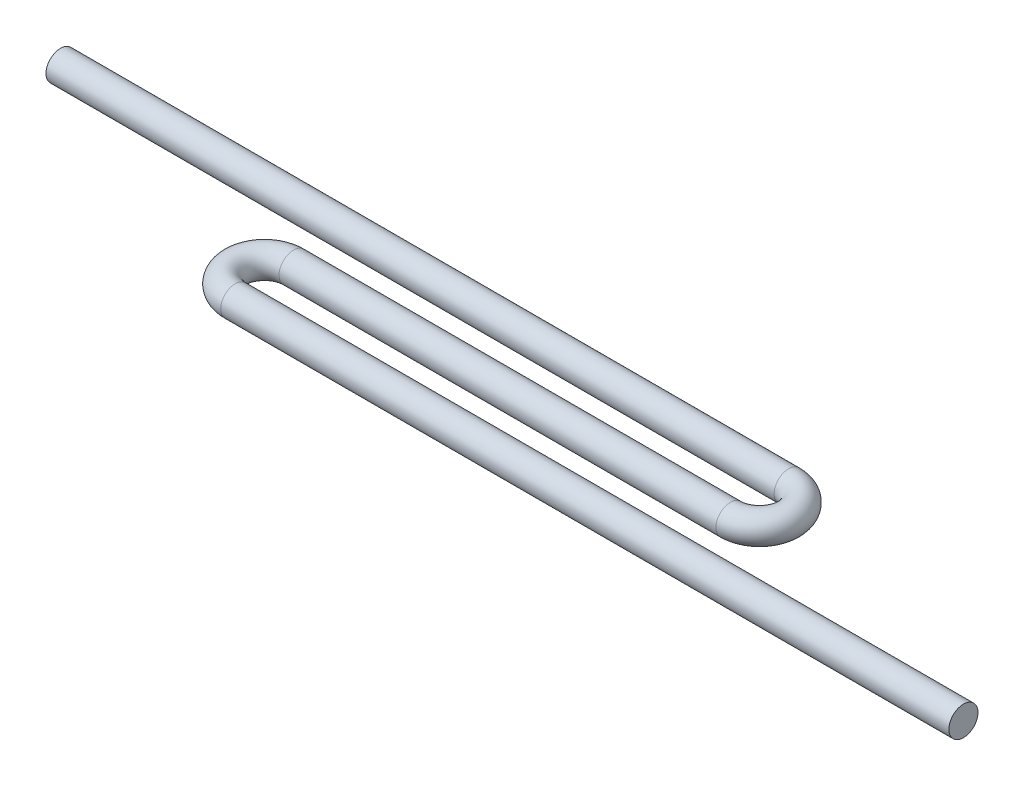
ISO-10303-21;
HEADER;
FILE_DESCRIPTION(('STEP AP214'),'2;1');
FILE_NAME('part.step','',(''),(''),'','','');
FILE_SCHEMA(('AUTOMOTIVE_DESIGN { 1 0 10303 214 1 1 1 1 }'));
ENDSEC;
DATA;
#1=APPLICATION_CONTEXT('core data for automotive mechanical design processes');
#2=APPLICATION_PROTOCOL_DEFINITION('international standard','automotive_design',2000,#1);
#3=PRODUCT_CONTEXT('',#1,'mechanical');
#4=PRODUCT('Part','Part','',(#3));
#5=PRODUCT_RELATED_PRODUCT_CATEGORY('part','',(#4));
#6=PRODUCT_DEFINITION_FORMATION('','',#4);
#7=PRODUCT_DEFINITION_CONTEXT('part definition',#1,'design');
#8=PRODUCT_DEFINITION('design','',#6,#7);
#9=PRODUCT_DEFINITION_SHAPE('','',#8);
#10=(LENGTH_UNIT() NAMED_UNIT(*) SI_UNIT(.MILLI.,.METRE.));
#11=(NAMED_UNIT(*) PLANE_ANGLE_UNIT() SI_UNIT($,.RADIAN.));
#12=(NAMED_UNIT(*) SI_UNIT($,.STERADIAN.) SOLID_ANGLE_UNIT());
#13=UNCERTAINTY_MEASURE_WITH_UNIT(LENGTH_MEASURE(1.E-05),#10,'distance_accuracy_value','');
#14=(GEOMETRIC_REPRESENTATION_CONTEXT(3) GLOBAL_UNCERTAINTY_ASSIGNED_CONTEXT((#13)) GLOBAL_UNIT_ASSIGNED_CONTEXT((#10,
#11,#12)) REPRESENTATION_CONTEXT('',''));
#15=CARTESIAN_POINT('',(0.,0.,0.));
#16=DIRECTION('',(0.,0.,1.));
#17=DIRECTION('',(1.,0.,0.));
#18=AXIS2_PLACEMENT_3D('',#15,#16,#17);
#19=CARTESIAN_POINT('',(100.,0.,40.));
#20=DIRECTION('',(1.,0.,0.));
#21=DIRECTION('',(0.,0.,-1.));
#22=AXIS2_PLACEMENT_3D('',#19,#20,#21);
#23=CYLINDRICAL_SURFACE('',#22,5.);
#24=CARTESIAN_POINT('',(100.,0.,40.));
#25=DIRECTION('',(1.,0.,0.));
#26=DIRECTION('',(0.,0.,-1.));
#27=AXIS2_PLACEMENT_3D('',#24,#25,#26);
#28=CIRCLE('',#27,5.);
#29=CARTESIAN_POINT('',(100.,0.,45.));
#30=VERTEX_POINT('',#29);
#31=EDGE_CURVE('E62',#30,#30,#28,.T.);
#32=ORIENTED_EDGE('',*,*,#31,.T.);
#33=EDGE_LOOP('',(#32));
#34=FACE_BOUND('',#33,.T.);
#35=CARTESIAN_POINT('',(350.,0.,40.));
#36=DIRECTION('',(1.,0.,0.));
#37=DIRECTION('',(0.,0.,-1.));
#38=AXIS2_PLACEMENT_3D('',#35,#36,#37);
#39=CIRCLE('',#38,5.);
#40=CARTESIAN_POINT('',(350.,0.,35.));
#41=VERTEX_POINT('',#40);
#42=EDGE_CURVE('E47',#41,#41,#39,.T.);
#43=ORIENTED_EDGE('',*,*,#42,.F.);
#44=EDGE_LOOP('',(#43));
#45=FACE_BOUND('',#44,.T.);
#46=ADVANCED_FACE('F30',(#34,#45),#23,.T.);
#47=CARTESIAN_POINT('',(100.,0.,30.));
#48=DIRECTION('',(0.,1.,0.));
#49=DIRECTION('',(0.,0.,1.));
#50=AXIS2_PLACEMENT_3D('',#47,#48,#49);
#51=TOROIDAL_SURFACE('',#50,10.,5.);
#52=CARTESIAN_POINT('',(100.,0.,20.));
#53=DIRECTION('',(-1.,0.,0.));
#54=DIRECTION('',(0.,0.,1.));
#55=AXIS2_PLACEMENT_3D('',#52,#53,#54);
#56=CIRCLE('',#55,5.);
#57=CARTESIAN_POINT('',(100.,0.,15.));
#58=VERTEX_POINT('',#57);
#59=EDGE_CURVE('E66',#58,#58,#56,.T.);
#60=CARTESIAN_POINT('',(100.,0.,30.));
#61=DIRECTION('',(0.,1.,0.));
#62=DIRECTION('',(0.,0.,1.));
#63=AXIS2_PLACEMENT_3D('',#60,#61,#62);
#64=CIRCLE('',#63,15.);
#65=EDGE_CURVE('',#58,#30,#64,.T.);
#66=ORIENTED_EDGE('',*,*,#59,.T.);
#67=ORIENTED_EDGE('',*,*,#31,.F.);
#68=ORIENTED_EDGE('',*,*,#65,.T.);
#69=ORIENTED_EDGE('',*,*,#65,.F.);
#70=EDGE_LOOP('',(#66,#68,#67,#69));
#71=FACE_BOUND('',#70,.T.);
#72=ADVANCED_FACE('F101',(#71),#51,.T.);
#73=CARTESIAN_POINT('',(250.,0.,20.));
#74=DIRECTION('',(-1.,0.,0.));
#75=DIRECTION('',(0.,0.,1.));
#76=AXIS2_PLACEMENT_3D('',#73,#74,#75);
#77=CYLINDRICAL_SURFACE('',#76,5.);
#78=CARTESIAN_POINT('',(250.,0.,20.));
#79=DIRECTION('',(-1.,0.,0.));
#80=DIRECTION('',(0.,0.,1.));
#81=AXIS2_PLACEMENT_3D('',#78,#79,#80);
#82=CIRCLE('',#81,5.);
#83=CARTESIAN_POINT('',(250.,0.,25.));
#84=VERTEX_POINT('',#83);
#85=EDGE_CURVE('E70',#84,#84,#82,.T.);
#86=ORIENTED_EDGE('',*,*,#85,.T.);
#87=EDGE_LOOP('',(#86));
#88=FACE_BOUND('',#87,.T.);
#89=ORIENTED_EDGE('',*,*,#59,.F.);
#90=EDGE_LOOP('',(#89));
#91=FACE_BOUND('',#90,.T.);
#92=ADVANCED_FACE('F106',(#88,#91),#77,.T.);
#93=CARTESIAN_POINT('',(250.,0.,10.));
#94=DIRECTION('',(0.,-1.,0.));
#95=DIRECTION('',(0.,0.,-1.));
#96=AXIS2_PLACEMENT_3D('',#93,#94,#95);
#97=TOROIDAL_SURFACE('',#96,10.,5.);
#98=CARTESIAN_POINT('',(250.,0.,0.));
#99=DIRECTION('',(1.,0.,0.));
#100=DIRECTION('',(0.,0.,-1.));
#101=AXIS2_PLACEMENT_3D('',#98,#99,#100);
#102=CIRCLE('',#101,5.);
#103=CARTESIAN_POINT('',(250.,0.,-5.));
#104=VERTEX_POINT('',#103);
#105=EDGE_CURVE('E75',#104,#104,#102,.T.);
#106=CARTESIAN_POINT('',(250.,0.,10.));
#107=DIRECTION('',(0.,-1.,0.));
#108=DIRECTION('',(0.,0.,-1.));
#109=AXIS2_PLACEMENT_3D('',#106,#107,#108);
#110=CIRCLE('',#109,15.);
#111=EDGE_CURVE('',#104,#84,#110,.T.);
#112=ORIENTED_EDGE('',*,*,#105,.T.);
#113=ORIENTED_EDGE('',*,*,#85,.F.);
#114=ORIENTED_EDGE('',*,*,#111,.T.);
#115=ORIENTED_EDGE('',*,*,#111,.F.);
#116=EDGE_LOOP('',(#112,#114,#113,#115));
#117=FACE_BOUND('',#116,.T.);
#118=ADVANCED_FACE('F82',(#117),#97,.T.);
#119=CARTESIAN_POINT('',(250.,0.,0.));
#120=DIRECTION('',(-1.,0.,0.));
#121=DIRECTION('',(0.,0.,1.));
#122=AXIS2_PLACEMENT_3D('',#119,#120,#121);
#123=CYLINDRICAL_SURFACE('',#122,5.);
#124=ORIENTED_EDGE('',*,*,#105,.F.);
#125=EDGE_LOOP('',(#124));
#126=FACE_BOUND('',#125,.T.);
#127=CARTESIAN_POINT('',(0.,0.,0.));
#128=DIRECTION('',(1.,0.,0.));
#129=DIRECTION('',(0.,0.,-1.));
#130=AXIS2_PLACEMENT_3D('',#127,#128,#129);
#131=CIRCLE('',#130,5.);
#132=CARTESIAN_POINT('',(0.,0.,-5.));
#133=VERTEX_POINT('',#132);
#134=EDGE_CURVE('E76',#133,#133,#131,.T.);
#135=ORIENTED_EDGE('',*,*,#134,.T.);
#136=EDGE_LOOP('',(#135));
#137=FACE_BOUND('',#136,.T.);
#138=ADVANCED_FACE('F85',(#126,#137),#123,.T.);
#139=CARTESIAN_POINT('',(350.,0.,40.));
#140=DIRECTION('',(1.,0.,0.));
#141=DIRECTION('',(0.,0.,-1.));
#142=AXIS2_PLACEMENT_3D('',#139,#140,#141);
#143=PLANE('',#142);
#144=ORIENTED_EDGE('',*,*,#42,.T.);
#145=EDGE_LOOP('',(#144));
#146=FACE_BOUND('',#145,.T.);
#147=ADVANCED_FACE('F88',(#146),#143,.T.);
#148=CARTESIAN_POINT('',(0.,0.,0.));
#149=DIRECTION('',(1.,0.,0.));
#150=DIRECTION('',(0.,0.,-1.));
#151=AXIS2_PLACEMENT_3D('',#148,#149,#150);
#152=PLANE('',#151);
#153=ORIENTED_EDGE('',*,*,#134,.F.);
#154=EDGE_LOOP('',(#153));
#155=FACE_BOUND('',#154,.T.);
#156=ADVANCED_FACE('F92',(#155),#152,.F.);
#157=CLOSED_SHELL('',(#46,#72,#92,#118,#138,#147,#156));
#158=CARTESIAN_POINT('',(100.,0.,40.));
#159=DIRECTION('',(1.,0.,0.));
#160=DIRECTION('',(0.,0.,-1.));
#161=AXIS2_PLACEMENT_3D('',#158,#159,#160);
#162=CYLINDRICAL_SURFACE('',#161,3.5);
#163=CARTESIAN_POINT('',(100.,0.,40.));
#164=DIRECTION('',(1.,0.,0.));
#165=DIRECTION('',(0.,0.,-1.));
#166=AXIS2_PLACEMENT_3D('',#163,#164,#165);
#167=CIRCLE('',#166,3.5);
#168=CARTESIAN_POINT('',(100.,0.,43.5));
#169=VERTEX_POINT('',#168);
#170=EDGE_CURVE('E34',#169,#169,#167,.T.);
#171=ORIENTED_EDGE('',*,*,#170,.F.);
#172=EDGE_LOOP('',(#171));
#173=FACE_BOUND('',#172,.T.);
#174=CARTESIAN_POINT('',(348.5,0.,40.));
#175=DIRECTION('',(1.,0.,0.));
#176=DIRECTION('',(0.,0.,-1.));
#177=AXIS2_PLACEMENT_3D('',#174,#175,#176);
#178=CIRCLE('',#177,3.5);
#179=CARTESIAN_POINT('',(348.5,0.,36.5));
#180=VERTEX_POINT('',#179);
#181=EDGE_CURVE('E10',#180,#180,#178,.T.);
#182=ORIENTED_EDGE('',*,*,#181,.T.);
#183=EDGE_LOOP('',(#182));
#184=FACE_BOUND('',#183,.T.);
#185=ADVANCED_FACE('F112',(#173,#184),#162,.F.);
#186=CARTESIAN_POINT('',(100.,0.,30.));
#187=DIRECTION('',(0.,1.,0.));
#188=DIRECTION('',(0.,0.,1.));
#189=AXIS2_PLACEMENT_3D('',#186,#187,#188);
#190=TOROIDAL_SURFACE('',#189,10.,3.5);
#191=CARTESIAN_POINT('',(100.,0.,20.));
#192=DIRECTION('',(1.,0.,0.));
#193=DIRECTION('',(0.,0.,-1.));
#194=AXIS2_PLACEMENT_3D('',#191,#192,#193);
#195=CIRCLE('',#194,3.5);
#196=CARTESIAN_POINT('',(100.,0.,16.5));
#197=VERTEX_POINT('',#196);
#198=EDGE_CURVE('E54',#197,#197,#195,.F.);
#199=CARTESIAN_POINT('',(100.,0.,30.));
#200=DIRECTION('',(0.,1.,0.));
#201=DIRECTION('',(0.,0.,1.));
#202=AXIS2_PLACEMENT_3D('',#199,#200,#201);
#203=CIRCLE('',#202,13.5);
#204=EDGE_CURVE('',#197,#169,#203,.T.);
#205=ORIENTED_EDGE('',*,*,#198,.F.);
#206=ORIENTED_EDGE('',*,*,#170,.T.);
#207=ORIENTED_EDGE('',*,*,#204,.T.);
#208=ORIENTED_EDGE('',*,*,#204,.F.);
#209=EDGE_LOOP('',(#205,#207,#206,#208));
#210=FACE_BOUND('',#209,.T.);
#211=ADVANCED_FACE('F114',(#210),#190,.F.);
#212=CARTESIAN_POINT('',(250.,0.,20.));
#213=DIRECTION('',(-1.,0.,0.));
#214=DIRECTION('',(0.,0.,1.));
#215=AXIS2_PLACEMENT_3D('',#212,#213,#214);
#216=CYLINDRICAL_SURFACE('',#215,3.5);
#217=CARTESIAN_POINT('',(250.,0.,20.));
#218=DIRECTION('',(-1.,0.,0.));
#219=DIRECTION('',(0.,0.,1.));
#220=AXIS2_PLACEMENT_3D('',#217,#218,#219);
#221=CIRCLE('',#220,3.5);
#222=CARTESIAN_POINT('',(250.,0.,23.5));
#223=VERTEX_POINT('',#222);
#224=EDGE_CURVE('E52',#223,#223,#221,.T.);
#225=ORIENTED_EDGE('',*,*,#224,.F.);
#226=EDGE_LOOP('',(#225));
#227=FACE_BOUND('',#226,.T.);
#228=ORIENTED_EDGE('',*,*,#198,.T.);
#229=EDGE_LOOP('',(#228));
#230=FACE_BOUND('',#229,.T.);
#231=ADVANCED_FACE('F119',(#227,#230),#216,.F.);
#232=CARTESIAN_POINT('',(250.,0.,10.));
#233=DIRECTION('',(0.,-1.,0.));
#234=DIRECTION('',(0.,0.,-1.));
#235=AXIS2_PLACEMENT_3D('',#232,#233,#234);
#236=TOROIDAL_SURFACE('',#235,10.,3.5);
#237=CARTESIAN_POINT('',(250.,0.,0.));
#238=DIRECTION('',(-1.,0.,0.));
#239=DIRECTION('',(0.,0.,1.));
#240=AXIS2_PLACEMENT_3D('',#237,#238,#239);
#241=CIRCLE('',#240,3.5);
#242=CARTESIAN_POINT('',(250.,0.,-3.5));
#243=VERTEX_POINT('',#242);
#244=EDGE_CURVE('E44',#243,#243,#241,.F.);
#245=CARTESIAN_POINT('',(250.,0.,10.));
#246=DIRECTION('',(0.,-1.,0.));
#247=DIRECTION('',(0.,0.,-1.));
#248=AXIS2_PLACEMENT_3D('',#245,#246,#247);
#249=CIRCLE('',#248,13.5);
#250=EDGE_CURVE('',#243,#223,#249,.T.);
#251=ORIENTED_EDGE('',*,*,#244,.F.);
#252=ORIENTED_EDGE('',*,*,#224,.T.);
#253=ORIENTED_EDGE('',*,*,#250,.T.);
#254=ORIENTED_EDGE('',*,*,#250,.F.);
#255=EDGE_LOOP('',(#251,#253,#252,#254));
#256=FACE_BOUND('',#255,.T.);
#257=ADVANCED_FACE('F123',(#256),#236,.F.);
#258=CARTESIAN_POINT('',(250.,0.,0.));
#259=DIRECTION('',(-1.,0.,0.));
#260=DIRECTION('',(0.,0.,1.));
#261=AXIS2_PLACEMENT_3D('',#258,#259,#260);
#262=CYLINDRICAL_SURFACE('',#261,3.5);
#263=ORIENTED_EDGE('',*,*,#244,.T.);
#264=EDGE_LOOP('',(#263));
#265=FACE_BOUND('',#264,.T.);
#266=CARTESIAN_POINT('',(1.5,0.,0.));
#267=DIRECTION('',(1.,0.,0.));
#268=DIRECTION('',(0.,0.,-1.));
#269=AXIS2_PLACEMENT_3D('',#266,#267,#268);
#270=CIRCLE('',#269,3.5);
#271=CARTESIAN_POINT('',(1.5,0.,-3.5));
#272=VERTEX_POINT('',#271);
#273=EDGE_CURVE('E39',#272,#272,#270,.T.);
#274=ORIENTED_EDGE('',*,*,#273,.F.);
#275=EDGE_LOOP('',(#274));
#276=FACE_BOUND('',#275,.T.);
#277=ADVANCED_FACE('F127',(#265,#276),#262,.F.);
#278=CARTESIAN_POINT('',(348.5,0.,40.));
#279=DIRECTION('',(1.,0.,0.));
#280=DIRECTION('',(0.,0.,-1.));
#281=AXIS2_PLACEMENT_3D('',#278,#279,#280);
#282=PLANE('',#281);
#283=ORIENTED_EDGE('',*,*,#181,.F.);
#284=EDGE_LOOP('',(#283));
#285=FACE_BOUND('',#284,.T.);
#286=ADVANCED_FACE('F130',(#285),#282,.F.);
#287=CARTESIAN_POINT('',(1.5,0.,0.));
#288=DIRECTION('',(1.,0.,0.));
#289=DIRECTION('',(0.,0.,-1.));
#290=AXIS2_PLACEMENT_3D('',#287,#288,#289);
#291=PLANE('',#290);
#292=ORIENTED_EDGE('',*,*,#273,.T.);
#293=EDGE_LOOP('',(#292));
#294=FACE_BOUND('',#293,.T.);
#295=ADVANCED_FACE('F32',(#294),#291,.T.);
#296=CLOSED_SHELL('',(#185,#211,#231,#257,#277,#286,#295));
#297=ORIENTED_CLOSED_SHELL('',*,#296,.T.);
#298=BREP_WITH_VOIDS('B2',#157,(#297));
#299=ADVANCED_BREP_SHAPE_REPRESENTATION('',(#18,#298),#14);
#300=SHAPE_DEFINITION_REPRESENTATION(#9,#299);
ENDSEC;
END-ISO-10303-21;
